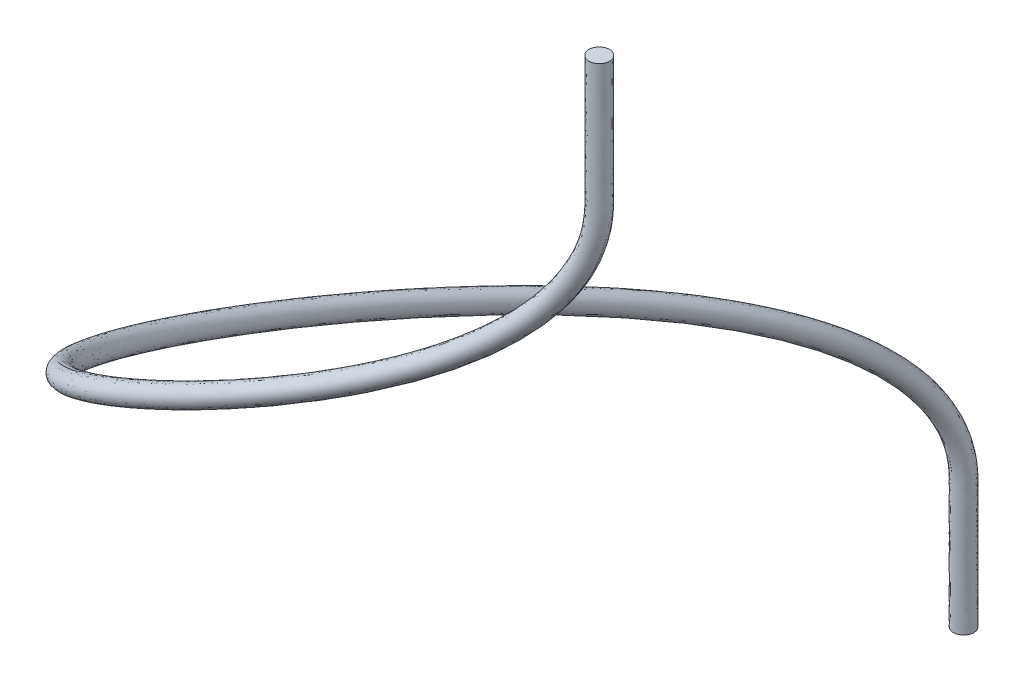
ISO-10303-21;
HEADER;
FILE_DESCRIPTION(('STEP AP214'),'2;1');
FILE_NAME('part.step','',(''),(''),'','','');
FILE_SCHEMA(('AUTOMOTIVE_DESIGN { 1 0 10303 214 1 1 1 1 }'));
ENDSEC;
DATA;
#1=APPLICATION_CONTEXT('core data for automotive mechanical design processes');
#2=APPLICATION_PROTOCOL_DEFINITION('international standard','automotive_design',2000,#1);
#3=PRODUCT_CONTEXT('',#1,'mechanical');
#4=PRODUCT('Part','Part','',(#3));
#5=PRODUCT_RELATED_PRODUCT_CATEGORY('part','',(#4));
#6=PRODUCT_DEFINITION_FORMATION('','',#4);
#7=PRODUCT_DEFINITION_CONTEXT('part definition',#1,'design');
#8=PRODUCT_DEFINITION('design','',#6,#7);
#9=PRODUCT_DEFINITION_SHAPE('','',#8);
#10=(LENGTH_UNIT() NAMED_UNIT(*) SI_UNIT(.MILLI.,.METRE.));
#11=(NAMED_UNIT(*) PLANE_ANGLE_UNIT() SI_UNIT($,.RADIAN.));
#12=(NAMED_UNIT(*) SI_UNIT($,.STERADIAN.) SOLID_ANGLE_UNIT());
#13=UNCERTAINTY_MEASURE_WITH_UNIT(LENGTH_MEASURE(1.E-05),#10,'distance_accuracy_value','');
#14=(GEOMETRIC_REPRESENTATION_CONTEXT(3) GLOBAL_UNCERTAINTY_ASSIGNED_CONTEXT((#13)) GLOBAL_UNIT_ASSIGNED_CONTEXT((#10,
#11,#12)) REPRESENTATION_CONTEXT('',''));
#15=CARTESIAN_POINT('',(0.,0.,0.));
#16=DIRECTION('',(0.,0.,1.));
#17=DIRECTION('',(1.,0.,0.));
#18=AXIS2_PLACEMENT_3D('',#15,#16,#17);
#19=CARTESIAN_POINT('',(161.925,157.6705,74.9299999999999));
#20=DIRECTION('',(0.,-1.,0.));
#21=DIRECTION('',(1.,0.,0.));
#22=AXIS2_PLACEMENT_3D('',#19,#20,#21);
#23=PLANE('',#22);
#24=CARTESIAN_POINT('',(162.738000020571,157.6705,74.9299999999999));
#25=CARTESIAN_POINT('',(162.738000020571,157.6705,75.3556858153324));
#26=CARTESIAN_POINT('',(162.350685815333,157.6705,75.743000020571));
#27=CARTESIAN_POINT('',(161.499314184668,157.6705,75.743000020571));
#28=CARTESIAN_POINT('',(161.111999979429,157.6705,75.3556858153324));
#29=CARTESIAN_POINT('',(161.111999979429,157.6705,74.5043141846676));
#30=CARTESIAN_POINT('',(161.499314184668,157.6705,74.1169999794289));
#31=CARTESIAN_POINT('',(162.350685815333,157.6705,74.1169999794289));
#32=CARTESIAN_POINT('',(162.738000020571,157.6705,74.5043141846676));
#33=CARTESIAN_POINT('',(162.738000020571,157.6705,74.9299999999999));
#34=B_SPLINE_CURVE_WITH_KNOTS('',3,(#24,#25,#26,#27,#28,#29,#30,#31,#32,#33),.UNSPECIFIED.,.T.,
.F.,(4,2,2,2,4),(0.,0.25,0.5,0.75,1.),.UNSPECIFIED.);
#35=CARTESIAN_POINT('',(162.738000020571,157.6705,74.9299999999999));
#36=VERTEX_POINT('',#35);
#37=EDGE_CURVE('E25',#36,#36,#34,.T.);
#38=ORIENTED_EDGE('',*,*,#37,.F.);
#39=EDGE_LOOP('',(#38));
#40=FACE_BOUND('',#39,.T.);
#41=ADVANCED_FACE('F15',(#40),#23,.F.);
#42=CARTESIAN_POINT('',(129.032,71.5645,13.3985000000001));
#43=DIRECTION('',(0.,-1.,0.));
#44=DIRECTION('',(-0.0694727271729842,0.,0.997583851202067));
#45=AXIS2_PLACEMENT_3D('',#42,#43,#44);
#46=PLANE('',#45);
#47=CARTESIAN_POINT('',(128.975518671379,71.5645,14.2095356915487));
#48=CARTESIAN_POINT('',(129.400175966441,71.5645,14.2391092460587));
#49=CARTESIAN_POINT('',(129.813462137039,71.5645,13.8796386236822));
#50=CARTESIAN_POINT('',(129.872609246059,71.5645,13.0303240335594));
#51=CARTESIAN_POINT('',(129.513138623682,71.5645,12.6170378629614));
#52=CARTESIAN_POINT('',(128.663824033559,71.5645,12.5578907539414));
#53=CARTESIAN_POINT('',(128.250537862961,71.5645,12.9173613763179));
#54=CARTESIAN_POINT('',(128.191390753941,71.5645,13.7666759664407));
#55=CARTESIAN_POINT('',(128.550861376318,71.5645,14.1799621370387));
#56=CARTESIAN_POINT('',(128.975518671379,71.5645,14.2095356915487));
#57=B_SPLINE_CURVE_WITH_KNOTS('',3,(#47,#48,#49,#50,#51,#52,#53,#54,#55,#56),.UNSPECIFIED.,.T.,
.F.,(4,2,2,2,4),(0.,0.25,0.5,0.75,1.),.UNSPECIFIED.);
#58=CARTESIAN_POINT('',(128.975518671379,71.5645,14.2095356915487));
#59=VERTEX_POINT('',#58);
#60=EDGE_CURVE('E10',#59,#59,#57,.F.);
#61=ORIENTED_EDGE('',*,*,#60,.T.);
#62=EDGE_LOOP('',(#61));
#63=FACE_BOUND('',#62,.T.);
#64=ADVANCED_FACE('F33',(#63),#46,.T.);
#65=CARTESIAN_POINT('',(162.738000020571,157.6705,74.9299999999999));
#66=CARTESIAN_POINT('',(162.738000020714,154.245916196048,74.9300000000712));
#67=CARTESIAN_POINT('',(162.738078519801,150.701110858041,74.9299756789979));
#68=CARTESIAN_POINT('',(162.737944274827,145.505333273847,74.9300172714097));
#69=CARTESIAN_POINT('',(162.04753096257,143.328142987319,75.1433726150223));
#70=CARTESIAN_POINT('',(159.806624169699,139.445901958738,75.7659576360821));
#71=CARTESIAN_POINT('',(158.250738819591,137.641316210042,76.1772051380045));
#72=CARTESIAN_POINT('',(152.805906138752,132.549465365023,77.466431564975));
#73=CARTESIAN_POINT('',(148.183420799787,129.591611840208,78.3876636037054));
#74=CARTESIAN_POINT('',(134.056013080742,121.543091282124,79.9866464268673));
#75=CARTESIAN_POINT('',(124.480334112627,117.360060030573,79.4839701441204));
#76=CARTESIAN_POINT('',(113.329195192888,109.333997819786,68.4932845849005));
#77=CARTESIAN_POINT('',(115.029077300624,106.090800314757,54.8428802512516));
#78=CARTESIAN_POINT('',(120.747998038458,99.5031600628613,34.7986740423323));
#79=CARTESIAN_POINT('',(123.249162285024,96.9986914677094,28.1317359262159));
#80=CARTESIAN_POINT('',(126.279737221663,92.1197703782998,20.3893633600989));
#81=CARTESIAN_POINT('',(127.215389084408,90.3217993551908,18.1899551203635));
#82=CARTESIAN_POINT('',(128.567358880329,86.3097744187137,15.1067518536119));
#83=CARTESIAN_POINT('',(128.982109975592,84.2274240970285,14.2100522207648));
#84=CARTESIAN_POINT('',(128.968534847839,78.7586484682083,14.2089884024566));
#85=CARTESIAN_POINT('',(128.975518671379,74.8202777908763,14.2095356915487));
#86=CARTESIAN_POINT('',(128.975518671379,71.5645,14.2095356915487));
#87=CARTESIAN_POINT('',(162.738000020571,157.6705,75.3556858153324));
#88=CARTESIAN_POINT('',(162.738000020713,154.260348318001,75.3556858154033));
#89=CARTESIAN_POINT('',(162.738077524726,150.6818949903,75.3556617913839));
#90=CARTESIAN_POINT('',(162.737944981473,145.518979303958,75.3557028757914));
#91=CARTESIAN_POINT('',(162.056098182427,143.375828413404,75.566494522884));
#92=CARTESIAN_POINT('',(159.828228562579,139.515975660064,76.1854840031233));
#93=CARTESIAN_POINT('',(158.277034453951,137.715476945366,76.5955628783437));
#94=CARTESIAN_POINT('',(152.837565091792,132.628546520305,77.8835365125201));
#95=CARTESIAN_POINT('',(148.208986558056,129.665104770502,78.806534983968));
#96=CARTESIAN_POINT('',(134.036744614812,121.590881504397,80.4106178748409));
#97=CARTESIAN_POINT('',(124.370976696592,117.378992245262,79.9574161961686));
#98=CARTESIAN_POINT('',(112.872830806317,109.103170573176,68.6247166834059));
#99=CARTESIAN_POINT('',(114.67276306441,105.856849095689,54.842136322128));
#100=CARTESIAN_POINT('',(120.400416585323,99.2591152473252,34.7677069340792));
#101=CARTESIAN_POINT('',(122.896960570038,96.7519207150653,28.1104061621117));
#102=CARTESIAN_POINT('',(125.88744709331,91.9578285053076,20.343116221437));
#103=CARTESIAN_POINT('',(126.815153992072,90.1807554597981,18.1448594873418));
#104=CARTESIAN_POINT('',(128.15035697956,86.2252837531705,15.0737993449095));
#105=CARTESIAN_POINT('',(128.557211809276,84.20612067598,14.1839431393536));
#106=CARTESIAN_POINT('',(128.544132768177,78.7812205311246,14.1757440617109));
#107=CARTESIAN_POINT('',(128.550861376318,74.8033249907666,14.1799621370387));
#108=CARTESIAN_POINT('',(128.550861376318,71.5645,14.1799621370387));
#109=CARTESIAN_POINT('',(162.350685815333,157.6705,75.743000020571));
#110=CARTESIAN_POINT('',(162.350685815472,154.315732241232,75.7430000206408));
#111=CARTESIAN_POINT('',(162.350759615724,150.608153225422,75.7429771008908));
#112=CARTESIAN_POINT('',(162.350633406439,145.571346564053,75.7430162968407));
#113=CARTESIAN_POINT('',(161.702455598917,143.567229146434,75.9436872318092));
#114=CARTESIAN_POINT('',(159.536884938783,139.815132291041,76.5454782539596));
#115=CARTESIAN_POINT('',(158.014257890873,138.043203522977,76.9482517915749));
#116=CARTESIAN_POINT('',(152.63670583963,133.014096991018,78.2216421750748));
#117=CARTESIAN_POINT('',(148.023620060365,130.055639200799,79.1429088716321));
#118=CARTESIAN_POINT('',(133.853586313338,121.98254573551,80.7468908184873));
#119=CARTESIAN_POINT('',(124.106872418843,117.746606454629,80.3527152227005));
#120=CARTESIAN_POINT('',(112.243760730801,109.208099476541,68.6603016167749));
#121=CARTESIAN_POINT('',(114.143528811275,105.95301939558,54.7233489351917));
#122=CARTESIAN_POINT('',(119.894089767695,99.3286199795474,34.5685017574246));
#123=CARTESIAN_POINT('',(122.38856400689,96.8172670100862,27.8999246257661));
#124=CARTESIAN_POINT('',(125.44216666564,92.0972429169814,20.0531725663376));
#125=CARTESIAN_POINT('',(126.390424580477,90.3245605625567,17.8277499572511));
#126=CARTESIAN_POINT('',(127.765109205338,86.3323567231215,14.6972983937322));
#127=CARTESIAN_POINT('',(128.19436798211,84.2346940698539,13.7735916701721));
#128=CARTESIAN_POINT('',(128.1882362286,78.7509455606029,13.7593484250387));
#129=CARTESIAN_POINT('',(128.191390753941,74.8260630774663,13.7666759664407));
#130=CARTESIAN_POINT('',(128.191390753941,71.5645,13.7666759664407));
#131=CARTESIAN_POINT('',(161.499314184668,157.6705,75.743000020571));
#132=CARTESIAN_POINT('',(161.499314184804,154.408609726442,75.7430000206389));
#133=CARTESIAN_POINT('',(161.499381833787,150.484490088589,75.7429789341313));
#134=CARTESIAN_POINT('',(161.499266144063,145.659165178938,75.7430149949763));
#135=CARTESIAN_POINT('',(160.907964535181,143.892584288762,75.9265665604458));
#136=CARTESIAN_POINT('',(158.85326149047,140.332573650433,76.4977440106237));
#137=CARTESIAN_POINT('',(157.384046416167,138.615271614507,76.8867966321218));
#138=CARTESIAN_POINT('',(152.131870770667,133.703429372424,78.1306365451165));
#139=CARTESIAN_POINT('',(147.565026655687,130.767103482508,79.0445636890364));
#140=CARTESIAN_POINT('',(133.489515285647,122.747898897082,80.6381236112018));
#141=CARTESIAN_POINT('',(123.745048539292,118.516810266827,80.274746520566));
#142=CARTESIAN_POINT('',(111.773704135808,109.900402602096,68.4756581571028));
#143=CARTESIAN_POINT('',(113.692825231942,106.632317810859,54.463725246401));
#144=CARTESIAN_POINT('',(119.476274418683,99.9694908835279,34.192554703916));
#145=CARTESIAN_POINT('',(121.975439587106,97.454448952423,27.4799158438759));
#146=CARTESIAN_POINT('',(125.247957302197,92.727579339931,19.5083295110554));
#147=CARTESIAN_POINT('',(126.257279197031,90.9227523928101,17.2208894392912));
#148=CARTESIAN_POINT('',(127.752283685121,86.7366996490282,13.9356008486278));
#149=CARTESIAN_POINT('',(128.246582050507,84.3401092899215,12.923799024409));
#150=CARTESIAN_POINT('',(128.254729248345,78.6392527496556,12.910540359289));
#151=CARTESIAN_POINT('',(128.250537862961,74.9099502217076,12.9173613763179));
#152=CARTESIAN_POINT('',(128.250537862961,71.5645,12.9173613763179));
#153=CARTESIAN_POINT('',(161.111999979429,157.6705,75.3556858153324));
#154=CARTESIAN_POINT('',(161.111999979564,154.437731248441,75.3556858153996));
#155=CARTESIAN_POINT('',(161.112065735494,150.445715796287,75.3556652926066));
#156=CARTESIAN_POINT('',(161.111953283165,145.686700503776,75.3557003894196));
#157=CARTESIAN_POINT('',(160.538732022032,143.997210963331,75.5337964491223));
#158=CARTESIAN_POINT('',(158.522603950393,140.50421586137,76.0943183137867));
#159=CARTESIAN_POINT('',(157.073419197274,138.808046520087,76.478192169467));
#160=CARTESIAN_POINT('',(151.873401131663,133.945074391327,77.7097285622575));
#161=CARTESIAN_POINT('',(147.333137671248,131.023901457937,78.6187095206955));
#162=CARTESIAN_POINT('',(133.341420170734,123.052598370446,80.2028878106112));
#163=CARTESIAN_POINT('',(123.679943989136,118.849973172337,79.8085069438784));
#164=CARTESIAN_POINT('',(111.975088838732,110.425372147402,68.2720736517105));
#165=CARTESIAN_POINT('',(113.811982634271,107.154213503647,54.3462916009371));
#166=CARTESIAN_POINT('',(119.602448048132,100.483088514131,34.0497009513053));
#167=CARTESIAN_POINT('',(122.107951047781,97.9688485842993,27.3082484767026));
#168=CARTESIAN_POINT('',(125.516534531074,93.1616823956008,19.3025426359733));
#169=CARTESIAN_POINT('',(126.560865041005,91.3232177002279,16.9858412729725));
#170=CARTESIAN_POINT('',(128.125862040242,86.9975218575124,13.6190641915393));
#171=CARTESIAN_POINT('',(128.65693333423,84.4074489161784,12.5609587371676));
#172=CARTESIAN_POINT('',(128.67112508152,78.5679029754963,12.554640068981));
#173=CARTESIAN_POINT('',(128.663824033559,74.9635376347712,12.5578907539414));
#174=CARTESIAN_POINT('',(128.663824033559,71.5645,12.5578907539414));
#175=CARTESIAN_POINT('',(161.111999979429,157.6705,74.5043141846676));
#176=CARTESIAN_POINT('',(161.111999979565,154.408867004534,74.5043141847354));
#177=CARTESIAN_POINT('',(161.112067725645,150.48414753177,74.5042930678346));
#178=CARTESIAN_POINT('',(161.111951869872,145.659408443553,74.5043291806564));
#179=CARTESIAN_POINT('',(160.521597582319,143.9018401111,74.6875526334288));
#180=CARTESIAN_POINT('',(158.479395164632,140.364068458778,75.2552655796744));
#181=CARTESIAN_POINT('',(157.020827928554,138.659725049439,75.6414766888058));
#182=CARTESIAN_POINT('',(151.810083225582,133.786912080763,76.8755186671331));
#183=CARTESIAN_POINT('',(147.282006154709,130.876915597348,77.7809667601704));
#184=CARTESIAN_POINT('',(133.379957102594,122.9570179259,79.354944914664));
#185=CARTESIAN_POINT('',(123.898658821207,118.812108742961,78.8616148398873));
#186=CARTESIAN_POINT('',(112.887817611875,110.887026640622,68.0092094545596));
#187=CARTESIAN_POINT('',(114.524611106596,107.62211594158,54.3477794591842));
#188=CARTESIAN_POINT('',(120.297610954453,100.971178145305,34.1116351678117));
#189=CARTESIAN_POINT('',(122.812354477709,98.4623900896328,27.3509080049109));
#190=CARTESIAN_POINT('',(126.301114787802,93.4855661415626,19.3950369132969));
#191=CARTESIAN_POINT('',(127.361335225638,91.6053054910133,17.0760325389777));
#192=CARTESIAN_POINT('',(128.959865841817,87.1665031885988,13.6849692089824));
#193=CARTESIAN_POINT('',(129.5067296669,84.4500557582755,12.6131768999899));
#194=CARTESIAN_POINT('',(129.519929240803,78.5227588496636,12.6211287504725));
#195=CARTESIAN_POINT('',(129.513138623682,74.9974432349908,12.6170378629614));
#196=CARTESIAN_POINT('',(129.513138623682,71.5645,12.6170378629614));
#197=CARTESIAN_POINT('',(161.499314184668,157.6705,74.1169999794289));
#198=CARTESIAN_POINT('',(161.499314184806,154.353483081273,74.116999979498));
#199=CARTESIAN_POINT('',(161.499385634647,150.557889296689,74.1169777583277));
#200=CARTESIAN_POINT('',(161.499263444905,145.607041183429,74.1170157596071));
#201=CARTESIAN_POINT('',(160.875240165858,143.710439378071,74.3103599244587));
#202=CARTESIAN_POINT('',(158.770738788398,140.064911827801,74.8952713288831));
#203=CARTESIAN_POINT('',(157.283604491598,138.331998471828,75.2887877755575));
#204=CARTESIAN_POINT('',(152.010942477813,133.40136161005,76.5374130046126));
#205=CARTESIAN_POINT('',(147.4673726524,130.486381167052,77.4445928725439));
#206=CARTESIAN_POINT('',(133.563115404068,122.565353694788,79.0186719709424));
#207=CARTESIAN_POINT('',(124.162763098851,118.444494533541,78.46631581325));
#208=CARTESIAN_POINT('',(113.516887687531,110.782097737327,67.9736245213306));
#209=CARTESIAN_POINT('',(115.053845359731,107.525945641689,54.4665668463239));
#210=CARTESIAN_POINT('',(120.803937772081,100.901673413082,34.3108403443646));
#211=CARTESIAN_POINT('',(123.320751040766,98.3970437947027,27.5613895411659));
#212=CARTESIAN_POINT('',(126.746395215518,93.3461517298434,19.6849805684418));
#213=CARTESIAN_POINT('',(127.786064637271,91.4615003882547,17.3931420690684));
#214=CARTESIAN_POINT('',(129.345113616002,87.0594302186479,14.0614701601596));
#215=CARTESIAN_POINT('',(129.86957349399,84.421482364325,13.0235283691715));
#216=CARTESIAN_POINT('',(129.875825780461,78.5530338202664,13.0375243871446));
#217=CARTESIAN_POINT('',(129.872609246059,74.9747051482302,13.0303240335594));
#218=CARTESIAN_POINT('',(129.872609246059,71.5645,13.0303240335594));
#219=CARTESIAN_POINT('',(162.350685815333,157.6705,74.1169999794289));
#220=CARTESIAN_POINT('',(162.350685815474,154.260605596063,74.1169999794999));
#221=CARTESIAN_POINT('',(162.350763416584,150.681552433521,74.1169759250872));
#222=CARTESIAN_POINT('',(162.350630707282,145.519222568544,74.1170170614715));
#223=CARTESIAN_POINT('',(161.669731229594,143.385084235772,74.3274805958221));
#224=CARTESIAN_POINT('',(159.454362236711,139.547470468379,74.943005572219));
#225=CARTESIAN_POINT('',(157.913815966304,137.759930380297,75.3502429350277));
#226=CARTESIAN_POINT('',(152.515777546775,132.712029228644,76.6284186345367));
#227=CARTESIAN_POINT('',(147.925966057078,129.774916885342,77.5429380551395));
#228=CARTESIAN_POINT('',(133.927186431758,121.800000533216,79.1274391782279));
#229=CARTESIAN_POINT('',(124.524586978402,117.674290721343,78.5442845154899));
#230=CARTESIAN_POINT('',(113.986944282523,110.089794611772,68.1582679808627));
#231=CARTESIAN_POINT('',(115.504548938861,106.846647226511,54.7261905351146));
#232=CARTESIAN_POINT('',(121.221753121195,100.260802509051,34.6867873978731));
#233=CARTESIAN_POINT('',(123.733875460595,97.7598618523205,27.9813983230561));
#234=CARTESIAN_POINT('',(126.940604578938,92.7158153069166,20.2298236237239));
#235=CARTESIAN_POINT('',(127.919210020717,90.8633085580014,18.0000025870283));
#236=CARTESIAN_POINT('',(129.357939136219,86.6550872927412,14.823167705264));
#237=CARTESIAN_POINT('',(129.817359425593,84.3160671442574,13.8733210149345));
#238=CARTESIAN_POINT('',(129.809332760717,78.6647266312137,13.8863324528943));
#239=CARTESIAN_POINT('',(129.813462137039,74.890818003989,13.8796386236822));
#240=CARTESIAN_POINT('',(129.813462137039,71.5645,13.8796386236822));
#241=CARTESIAN_POINT('',(162.738000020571,157.6705,74.5043141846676));
#242=CARTESIAN_POINT('',(162.738000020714,154.231484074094,74.5043141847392));
#243=CARTESIAN_POINT('',(162.738079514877,150.720326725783,74.5042895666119));
#244=CARTESIAN_POINT('',(162.73794356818,145.491687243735,74.5043316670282));
#245=CARTESIAN_POINT('',(162.038963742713,143.280457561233,74.7202507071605));
#246=CARTESIAN_POINT('',(159.785019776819,139.375828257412,75.346431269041));
#247=CARTESIAN_POINT('',(158.224443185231,137.567155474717,75.7588473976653));
#248=CARTESIAN_POINT('',(152.774247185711,132.470384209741,77.04932661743));
#249=CARTESIAN_POINT('',(148.157855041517,129.518118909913,77.9687922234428));
#250=CARTESIAN_POINT('',(134.075281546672,121.495301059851,79.5626749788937));
#251=CARTESIAN_POINT('',(124.589691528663,117.341127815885,79.0105240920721));
#252=CARTESIAN_POINT('',(113.78555957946,109.564825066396,68.3618524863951));
#253=CARTESIAN_POINT('',(115.385391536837,106.324751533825,54.8436241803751));
#254=CARTESIAN_POINT('',(121.095579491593,99.7472048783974,34.8296411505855));
#255=CARTESIAN_POINT('',(123.601364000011,97.2454622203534,28.1530656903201));
#256=CARTESIAN_POINT('',(126.672027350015,92.2817122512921,20.4356104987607));
#257=CARTESIAN_POINT('',(127.615624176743,90.4628432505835,18.2350507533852));
#258=CARTESIAN_POINT('',(128.984360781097,86.3942650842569,15.1397043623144));
#259=CARTESIAN_POINT('',(129.407008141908,84.248727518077,14.236161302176));
#260=CARTESIAN_POINT('',(129.392936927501,78.7360764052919,14.2422327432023));
#261=CARTESIAN_POINT('',(129.400175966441,74.8372305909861,14.2391092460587));
#262=CARTESIAN_POINT('',(129.400175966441,71.5645,14.2391092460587));
#263=CARTESIAN_POINT('',(162.738000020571,157.6705,74.9299999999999));
#264=CARTESIAN_POINT('',(162.738000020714,154.245916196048,74.9300000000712));
#265=CARTESIAN_POINT('',(162.738078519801,150.701110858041,74.9299756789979));
#266=CARTESIAN_POINT('',(162.737944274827,145.505333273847,74.9300172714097));
#267=CARTESIAN_POINT('',(162.04753096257,143.328142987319,75.1433726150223));
#268=CARTESIAN_POINT('',(159.806624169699,139.445901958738,75.7659576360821));
#269=CARTESIAN_POINT('',(158.250738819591,137.641316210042,76.1772051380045));
#270=CARTESIAN_POINT('',(152.805906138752,132.549465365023,77.466431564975));
#271=CARTESIAN_POINT('',(148.183420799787,129.591611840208,78.3876636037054));
#272=CARTESIAN_POINT('',(134.056013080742,121.543091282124,79.9866464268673));
#273=CARTESIAN_POINT('',(124.480334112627,117.360060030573,79.4839701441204));
#274=CARTESIAN_POINT('',(113.329195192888,109.333997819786,68.4932845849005));
#275=CARTESIAN_POINT('',(115.029077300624,106.090800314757,54.8428802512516));
#276=CARTESIAN_POINT('',(120.747998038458,99.5031600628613,34.7986740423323));
#277=CARTESIAN_POINT('',(123.249162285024,96.9986914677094,28.1317359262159));
#278=CARTESIAN_POINT('',(126.279737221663,92.1197703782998,20.3893633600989));
#279=CARTESIAN_POINT('',(127.215389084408,90.3217993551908,18.1899551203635));
#280=CARTESIAN_POINT('',(128.567358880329,86.3097744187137,15.1067518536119));
#281=CARTESIAN_POINT('',(128.982109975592,84.2274240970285,14.2100522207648));
#282=CARTESIAN_POINT('',(128.968534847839,78.7586484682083,14.2089884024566));
#283=CARTESIAN_POINT('',(128.975518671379,74.8202777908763,14.2095356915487));
#284=CARTESIAN_POINT('',(128.975518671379,71.5645,14.2095356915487));
#285=B_SPLINE_SURFACE_WITH_KNOTS('',3,3,((#65,#66,#67,#68,#69,#70,#71,#72,#73,#74,#75,#76,#77,
#78,#79,#80,#81,#82,#83,#84,#85,#86),(#87,#88,#89,#90,#91,#92,#93,#94,#95,#96,#97,#98,#99,#100,
#101,#102,#103,#104,#105,#106,#107,#108),(#109,#110,#111,#112,#113,#114,#115,#116,#117,#118,
#119,#120,#121,#122,#123,#124,#125,#126,#127,#128,#129,#130),(#131,#132,#133,#134,#135,#136,
#137,#138,#139,#140,#141,#142,#143,#144,#145,#146,#147,#148,#149,#150,#151,#152),(#153,#154,
#155,#156,#157,#158,#159,#160,#161,#162,#163,#164,#165,#166,#167,#168,#169,#170,#171,#172,#173,
#174),(#175,#176,#177,#178,#179,#180,#181,#182,#183,#184,#185,#186,#187,#188,#189,#190,#191,
#192,#193,#194,#195,#196),(#197,#198,#199,#200,#201,#202,#203,#204,#205,#206,#207,#208,#209,
#210,#211,#212,#213,#214,#215,#216,#217,#218),(#219,#220,#221,#222,#223,#224,#225,#226,#227,
#228,#229,#230,#231,#232,#233,#234,#235,#236,#237,#238,#239,#240),(#241,#242,#243,#244,#245,
#246,#247,#248,#249,#250,#251,#252,#253,#254,#255,#256,#257,#258,#259,#260,#261,#262),(#263,
#264,#265,#266,#267,#268,#269,#270,#271,#272,#273,#274,#275,#276,#277,#278,#279,#280,#281,#282,
#283,#284)),.UNSPECIFIED.,.T.,.F.,.F.,(4,2,2,2,4),(4,2,2,2,2,2,2,2,2,2,4),(0.,0.25,0.5,0.75,1.),
(0.,0.0656533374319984,0.112276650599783,0.158899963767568,0.252146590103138,0.438639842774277,
0.686493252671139,0.810419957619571,0.872383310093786,0.934346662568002,1.),.UNSPECIFIED.);
#286=ORIENTED_EDGE('',*,*,#60,.F.);
#287=EDGE_LOOP('',(#286));
#288=FACE_BOUND('',#287,.T.);
#289=ORIENTED_EDGE('',*,*,#37,.T.);
#290=EDGE_LOOP('',(#289));
#291=FACE_BOUND('',#290,.T.);
#292=ADVANCED_FACE('F50',(#288,#291),#285,.T.);
#293=CLOSED_SHELL('',(#41,#64,#292));
#294=MANIFOLD_SOLID_BREP('B1',#293);
#295=ADVANCED_BREP_SHAPE_REPRESENTATION('',(#18,#294),#14);
#296=SHAPE_DEFINITION_REPRESENTATION(#9,#295);
ENDSEC;
END-ISO-10303-21;
